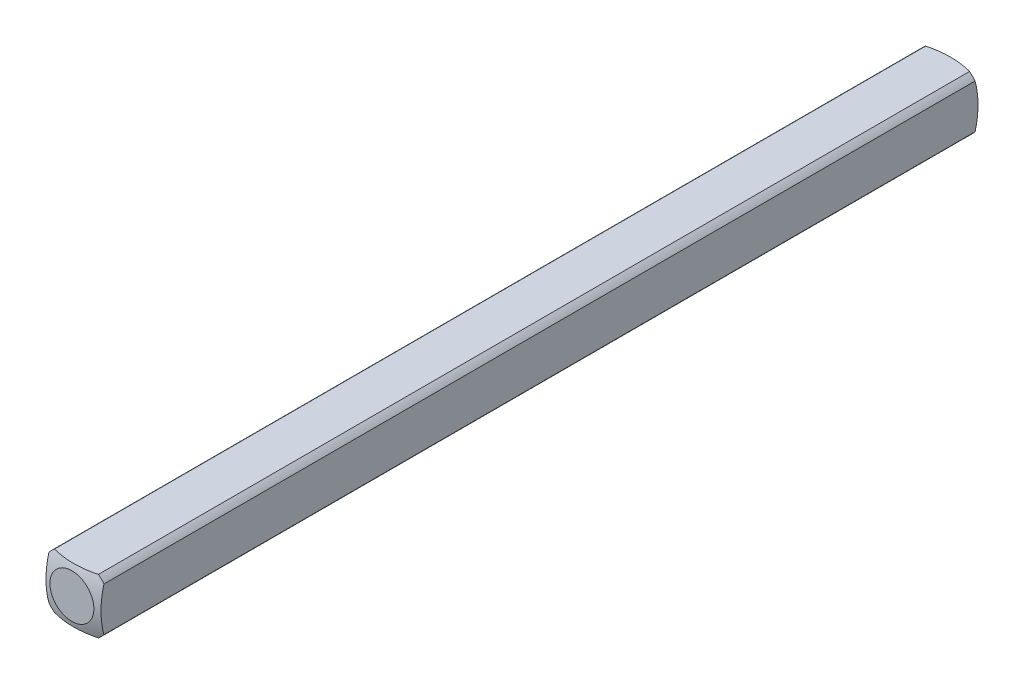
from build123d import *

# Parameters (mm, degrees)
SKETCH1_W           = 3.175
SKETCH1_H           = 3.175
BOSS_EXTRUDE1_DEPTH = 25.4
SKETCH2_OUTSIDE_W   = 10.334
SKETCH2_OUTSIDE_H   = 10.334
SKETCH2_OUTSIDE_R   = 2.032
CUT_EXTRUDE1_DEPTH  = 26.499025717


with BuildPart() as part:
    # Sketch1 → Boss-Extrude1 (new body)
    with BuildSketch(Plane.XY):
        Rectangle(SKETCH1_W, SKETCH1_H)
    extrude(amount=BOSS_EXTRUDE1_DEPTH)

    # Sketch2 outside → Cut-Extrude1 (cut, through all)
    with BuildSketch(Plane(origin=(0, 0, 0), x_dir=(-1, 0, 0), z_dir=(0, 0, -1))):
        Rectangle(SKETCH2_OUTSIDE_W, SKETCH2_OUTSIDE_H)
        Circle(SKETCH2_OUTSIDE_R, mode=Mode.SUBTRACT)
    extrude(amount=-CUT_EXTRUDE1_DEPTH, mode=Mode.SUBTRACT)

    # Sketch3 → Cut-Revolve1 (revolve, cut)
    with BuildSketch(Plane(origin=(0, 0, 0), x_dir=(1, 0, 0), z_dir=(0, 1, 0))):
        with BuildLine():
            Line((-5.053685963, -4.40273269), (-5.053685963, 5.740530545))
            Line((-5.053685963, 5.740530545), (0, 5.740530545))
            Line((0, 5.740530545), (0, 0.160877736))
            ThreePointArc((0, 0.160877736), (-3.404639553, -1.148866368), (-5.053685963, -4.40273269))
        make_face()
    revolve(axis=Axis((0, 0, 25.4), (0, 0, -1)), mode=Mode.SUBTRACT)

    # Mirror1: part across plane


with BuildPart() as part_1:
    add(part.part)
    add(part.part.mirror(Plane(origin=(0, 0, 25.4), x_dir=(1, 0, 0), z_dir=(0, 0, -1))))


solid = part_1.part
